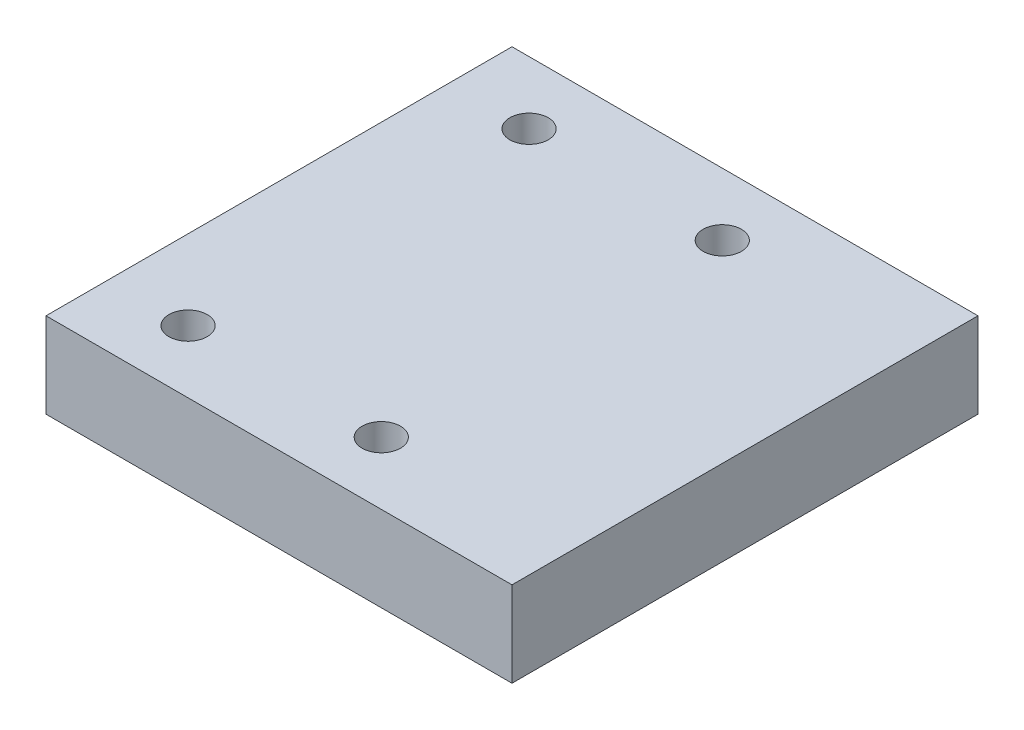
ISO-10303-21;
HEADER;
FILE_DESCRIPTION(('STEP AP214'),'2;1');
FILE_NAME('part.step','',(''),(''),'','','');
FILE_SCHEMA(('AUTOMOTIVE_DESIGN { 1 0 10303 214 1 1 1 1 }'));
ENDSEC;
DATA;
#1=APPLICATION_CONTEXT('core data for automotive mechanical design processes');
#2=APPLICATION_PROTOCOL_DEFINITION('international standard','automotive_design',2000,#1);
#3=PRODUCT_CONTEXT('',#1,'mechanical');
#4=PRODUCT('Part','Part','',(#3));
#5=PRODUCT_RELATED_PRODUCT_CATEGORY('part','',(#4));
#6=PRODUCT_DEFINITION_FORMATION('','',#4);
#7=PRODUCT_DEFINITION_CONTEXT('part definition',#1,'design');
#8=PRODUCT_DEFINITION('design','',#6,#7);
#9=PRODUCT_DEFINITION_SHAPE('','',#8);
#10=(LENGTH_UNIT() NAMED_UNIT(*) SI_UNIT(.MILLI.,.METRE.));
#11=(NAMED_UNIT(*) PLANE_ANGLE_UNIT() SI_UNIT($,.RADIAN.));
#12=(NAMED_UNIT(*) SI_UNIT($,.STERADIAN.) SOLID_ANGLE_UNIT());
#13=UNCERTAINTY_MEASURE_WITH_UNIT(LENGTH_MEASURE(1.E-05),#10,'distance_accuracy_value','');
#14=(GEOMETRIC_REPRESENTATION_CONTEXT(3) GLOBAL_UNCERTAINTY_ASSIGNED_CONTEXT((#13)) GLOBAL_UNIT_ASSIGNED_CONTEXT((#10,
#11,#12)) REPRESENTATION_CONTEXT('',''));
#15=CARTESIAN_POINT('',(0.,0.,0.));
#16=DIRECTION('',(0.,0.,1.));
#17=DIRECTION('',(1.,0.,0.));
#18=AXIS2_PLACEMENT_3D('',#15,#16,#17);
#19=CARTESIAN_POINT('',(-41.,0.,41.));
#20=DIRECTION('',(1.,0.,0.));
#21=DIRECTION('',(0.,0.,-1.));
#22=AXIS2_PLACEMENT_3D('',#19,#20,#21);
#23=PLANE('',#22);
#24=DIRECTION('',(0.,-1.,0.));
#25=VECTOR('',#24,1.);
#26=CARTESIAN_POINT('',(-41.,0.,-41.));
#27=LINE('',#26,#25);
#28=CARTESIAN_POINT('',(-41.,15.,-41.));
#29=VERTEX_POINT('',#28);
#30=CARTESIAN_POINT('',(-41.,0.,-41.));
#31=VERTEX_POINT('',#30);
#32=EDGE_CURVE('E96',#29,#31,#27,.T.);
#33=ORIENTED_EDGE('',*,*,#32,.T.);
#34=DIRECTION('',(0.,0.,-1.));
#35=VECTOR('',#34,1.);
#36=CARTESIAN_POINT('',(-41.,0.,41.));
#37=LINE('',#36,#35);
#38=CARTESIAN_POINT('',(-41.,0.,41.));
#39=VERTEX_POINT('',#38);
#40=EDGE_CURVE('E11',#39,#31,#37,.T.);
#41=ORIENTED_EDGE('',*,*,#40,.F.);
#42=DIRECTION('',(0.,-1.,0.));
#43=VECTOR('',#42,1.);
#44=CARTESIAN_POINT('',(-41.,0.,41.));
#45=LINE('',#44,#43);
#46=CARTESIAN_POINT('',(-41.,15.,41.));
#47=VERTEX_POINT('',#46);
#48=EDGE_CURVE('E84',#47,#39,#45,.T.);
#49=ORIENTED_EDGE('',*,*,#48,.F.);
#50=DIRECTION('',(0.,0.,-1.));
#51=VECTOR('',#50,1.);
#52=CARTESIAN_POINT('',(-41.,15.,41.));
#53=LINE('',#52,#51);
#54=EDGE_CURVE('E92',#47,#29,#53,.T.);
#55=ORIENTED_EDGE('',*,*,#54,.T.);
#56=EDGE_LOOP('',(#33,#41,#49,#55));
#57=FACE_BOUND('',#56,.T.);
#58=ADVANCED_FACE('F33',(#57),#23,.F.);
#59=CARTESIAN_POINT('',(-41.,0.,41.));
#60=DIRECTION('',(0.,1.,0.));
#61=DIRECTION('',(-1.,0.,0.));
#62=AXIS2_PLACEMENT_3D('',#59,#60,#61);
#63=PLANE('',#62);
#64=CARTESIAN_POINT('',(-27.,0.,30.));
#65=DIRECTION('',(0.,1.,0.));
#66=DIRECTION('',(0.,0.,-1.));
#67=AXIS2_PLACEMENT_3D('',#64,#65,#66);
#68=CIRCLE('',#67,3.375);
#69=CARTESIAN_POINT('',(-27.,0.,26.625));
#70=VERTEX_POINT('',#69);
#71=EDGE_CURVE('E125',#70,#70,#68,.T.);
#72=ORIENTED_EDGE('',*,*,#71,.T.);
#73=EDGE_LOOP('',(#72));
#74=FACE_BOUND('',#73,.T.);
#75=CARTESIAN_POINT('',(7.,0.,30.));
#76=DIRECTION('',(0.,1.,0.));
#77=DIRECTION('',(0.,0.,1.));
#78=AXIS2_PLACEMENT_3D('',#75,#76,#77);
#79=CIRCLE('',#78,3.375);
#80=CARTESIAN_POINT('',(7.,0.,33.375));
#81=VERTEX_POINT('',#80);
#82=EDGE_CURVE('E119',#81,#81,#79,.T.);
#83=ORIENTED_EDGE('',*,*,#82,.T.);
#84=EDGE_LOOP('',(#83));
#85=FACE_BOUND('',#84,.T.);
#86=CARTESIAN_POINT('',(7.,0.,-30.));
#87=DIRECTION('',(0.,1.,0.));
#88=DIRECTION('',(0.,0.,-1.));
#89=AXIS2_PLACEMENT_3D('',#86,#87,#88);
#90=CIRCLE('',#89,3.375);
#91=CARTESIAN_POINT('',(7.,0.,-33.375));
#92=VERTEX_POINT('',#91);
#93=EDGE_CURVE('E113',#92,#92,#90,.T.);
#94=ORIENTED_EDGE('',*,*,#93,.T.);
#95=EDGE_LOOP('',(#94));
#96=FACE_BOUND('',#95,.T.);
#97=CARTESIAN_POINT('',(-27.,0.,-30.));
#98=DIRECTION('',(0.,1.,0.));
#99=DIRECTION('',(0.,0.,1.));
#100=AXIS2_PLACEMENT_3D('',#97,#98,#99);
#101=CIRCLE('',#100,3.375);
#102=CARTESIAN_POINT('',(-27.,0.,-26.625));
#103=VERTEX_POINT('',#102);
#104=EDGE_CURVE('E99',#103,#103,#101,.T.);
#105=ORIENTED_EDGE('',*,*,#104,.T.);
#106=EDGE_LOOP('',(#105));
#107=FACE_BOUND('',#106,.T.);
#108=DIRECTION('',(1.,0.,0.));
#109=VECTOR('',#108,1.);
#110=CARTESIAN_POINT('',(-41.,0.,-41.));
#111=LINE('',#110,#109);
#112=CARTESIAN_POINT('',(41.,0.,-41.));
#113=VERTEX_POINT('',#112);
#114=EDGE_CURVE('E88',#31,#113,#111,.T.);
#115=ORIENTED_EDGE('',*,*,#114,.T.);
#116=DIRECTION('',(0.,0.,-1.));
#117=VECTOR('',#116,1.);
#118=CARTESIAN_POINT('',(41.,0.,41.));
#119=LINE('',#118,#117);
#120=CARTESIAN_POINT('',(41.,0.,41.));
#121=VERTEX_POINT('',#120);
#122=EDGE_CURVE('E41',#121,#113,#119,.T.);
#123=ORIENTED_EDGE('',*,*,#122,.F.);
#124=DIRECTION('',(1.,0.,0.));
#125=VECTOR('',#124,1.);
#126=CARTESIAN_POINT('',(-41.,0.,41.));
#127=LINE('',#126,#125);
#128=EDGE_CURVE('E79',#39,#121,#127,.T.);
#129=ORIENTED_EDGE('',*,*,#128,.F.);
#130=ORIENTED_EDGE('',*,*,#40,.T.);
#131=EDGE_LOOP('',(#115,#123,#129,#130));
#132=FACE_BOUND('',#131,.T.);
#133=ADVANCED_FACE('F87',(#74,#85,#96,#107,#132),#63,.F.);
#134=CARTESIAN_POINT('',(41.,0.,41.));
#135=DIRECTION('',(-1.,0.,0.));
#136=DIRECTION('',(0.,0.,1.));
#137=AXIS2_PLACEMENT_3D('',#134,#135,#136);
#138=PLANE('',#137);
#139=DIRECTION('',(0.,1.,0.));
#140=VECTOR('',#139,1.);
#141=CARTESIAN_POINT('',(41.,0.,-41.));
#142=LINE('',#141,#140);
#143=CARTESIAN_POINT('',(41.,15.,-41.));
#144=VERTEX_POINT('',#143);
#145=EDGE_CURVE('E66',#113,#144,#142,.T.);
#146=ORIENTED_EDGE('',*,*,#145,.T.);
#147=DIRECTION('',(0.,0.,-1.));
#148=VECTOR('',#147,1.);
#149=CARTESIAN_POINT('',(41.,15.,41.));
#150=LINE('',#149,#148);
#151=CARTESIAN_POINT('',(41.,15.,41.));
#152=VERTEX_POINT('',#151);
#153=EDGE_CURVE('E89',#152,#144,#150,.T.);
#154=ORIENTED_EDGE('',*,*,#153,.F.);
#155=DIRECTION('',(0.,1.,0.));
#156=VECTOR('',#155,1.);
#157=CARTESIAN_POINT('',(41.,0.,41.));
#158=LINE('',#157,#156);
#159=EDGE_CURVE('E82',#121,#152,#158,.T.);
#160=ORIENTED_EDGE('',*,*,#159,.F.);
#161=ORIENTED_EDGE('',*,*,#122,.T.);
#162=EDGE_LOOP('',(#146,#154,#160,#161));
#163=FACE_BOUND('',#162,.T.);
#164=ADVANCED_FACE('F90',(#163),#138,.F.);
#165=CARTESIAN_POINT('',(-41.,15.,41.));
#166=DIRECTION('',(0.,-1.,0.));
#167=DIRECTION('',(0.,0.,-1.));
#168=AXIS2_PLACEMENT_3D('',#165,#166,#167);
#169=PLANE('',#168);
#170=CARTESIAN_POINT('',(-27.,15.,30.));
#171=DIRECTION('',(0.,1.,0.));
#172=DIRECTION('',(0.,0.,-1.));
#173=AXIS2_PLACEMENT_3D('',#170,#171,#172);
#174=CIRCLE('',#173,3.375);
#175=CARTESIAN_POINT('',(-27.,15.,26.625));
#176=VERTEX_POINT('',#175);
#177=EDGE_CURVE('E128',#176,#176,#174,.T.);
#178=ORIENTED_EDGE('',*,*,#177,.F.);
#179=EDGE_LOOP('',(#178));
#180=FACE_BOUND('',#179,.T.);
#181=CARTESIAN_POINT('',(7.,15.,30.));
#182=DIRECTION('',(0.,1.,0.));
#183=DIRECTION('',(0.,0.,1.));
#184=AXIS2_PLACEMENT_3D('',#181,#182,#183);
#185=CIRCLE('',#184,3.375);
#186=CARTESIAN_POINT('',(7.,15.,33.375));
#187=VERTEX_POINT('',#186);
#188=EDGE_CURVE('E122',#187,#187,#185,.T.);
#189=ORIENTED_EDGE('',*,*,#188,.F.);
#190=EDGE_LOOP('',(#189));
#191=FACE_BOUND('',#190,.T.);
#192=CARTESIAN_POINT('',(7.,15.,-30.));
#193=DIRECTION('',(0.,1.,0.));
#194=DIRECTION('',(0.,0.,-1.));
#195=AXIS2_PLACEMENT_3D('',#192,#193,#194);
#196=CIRCLE('',#195,3.375);
#197=CARTESIAN_POINT('',(7.,15.,-33.375));
#198=VERTEX_POINT('',#197);
#199=EDGE_CURVE('E116',#198,#198,#196,.T.);
#200=ORIENTED_EDGE('',*,*,#199,.F.);
#201=EDGE_LOOP('',(#200));
#202=FACE_BOUND('',#201,.T.);
#203=CARTESIAN_POINT('',(-27.,15.,-30.));
#204=DIRECTION('',(0.,1.,0.));
#205=DIRECTION('',(0.,0.,1.));
#206=AXIS2_PLACEMENT_3D('',#203,#204,#205);
#207=CIRCLE('',#206,3.375);
#208=CARTESIAN_POINT('',(-27.,15.,-26.625));
#209=VERTEX_POINT('',#208);
#210=EDGE_CURVE('E110',#209,#209,#207,.T.);
#211=ORIENTED_EDGE('',*,*,#210,.F.);
#212=EDGE_LOOP('',(#211));
#213=FACE_BOUND('',#212,.T.);
#214=DIRECTION('',(-1.,0.,0.));
#215=VECTOR('',#214,1.);
#216=CARTESIAN_POINT('',(-41.,15.,-41.));
#217=LINE('',#216,#215);
#218=EDGE_CURVE('E72',#144,#29,#217,.T.);
#219=ORIENTED_EDGE('',*,*,#218,.T.);
#220=ORIENTED_EDGE('',*,*,#54,.F.);
#221=DIRECTION('',(-1.,0.,0.));
#222=VECTOR('',#221,1.);
#223=CARTESIAN_POINT('',(-41.,15.,41.));
#224=LINE('',#223,#222);
#225=EDGE_CURVE('E49',#152,#47,#224,.T.);
#226=ORIENTED_EDGE('',*,*,#225,.F.);
#227=ORIENTED_EDGE('',*,*,#153,.T.);
#228=EDGE_LOOP('',(#219,#220,#226,#227));
#229=FACE_BOUND('',#228,.T.);
#230=ADVANCED_FACE('F104',(#180,#191,#202,#213,#229),#169,.F.);
#231=CARTESIAN_POINT('',(-41.,15.,41.));
#232=DIRECTION('',(0.,0.,-1.));
#233=DIRECTION('',(-1.,0.,0.));
#234=AXIS2_PLACEMENT_3D('',#231,#232,#233);
#235=PLANE('',#234);
#236=ORIENTED_EDGE('',*,*,#48,.T.);
#237=ORIENTED_EDGE('',*,*,#128,.T.);
#238=ORIENTED_EDGE('',*,*,#159,.T.);
#239=ORIENTED_EDGE('',*,*,#225,.T.);
#240=EDGE_LOOP('',(#236,#237,#238,#239));
#241=FACE_BOUND('',#240,.T.);
#242=ADVANCED_FACE('F80',(#241),#235,.F.);
#243=CARTESIAN_POINT('',(-41.,15.,-41.));
#244=DIRECTION('',(0.,0.,-1.));
#245=DIRECTION('',(-1.,0.,0.));
#246=AXIS2_PLACEMENT_3D('',#243,#244,#245);
#247=PLANE('',#246);
#248=ORIENTED_EDGE('',*,*,#32,.F.);
#249=ORIENTED_EDGE('',*,*,#218,.F.);
#250=ORIENTED_EDGE('',*,*,#145,.F.);
#251=ORIENTED_EDGE('',*,*,#114,.F.);
#252=EDGE_LOOP('',(#248,#249,#250,#251));
#253=FACE_BOUND('',#252,.T.);
#254=ADVANCED_FACE('F107',(#253),#247,.T.);
#255=CARTESIAN_POINT('',(-27.,0.,-30.));
#256=DIRECTION('',(0.,1.,0.));
#257=DIRECTION('',(0.,0.,1.));
#258=AXIS2_PLACEMENT_3D('',#255,#256,#257);
#259=CYLINDRICAL_SURFACE('',#258,3.375);
#260=ORIENTED_EDGE('',*,*,#104,.F.);
#261=EDGE_LOOP('',(#260));
#262=FACE_BOUND('',#261,.T.);
#263=ORIENTED_EDGE('',*,*,#210,.T.);
#264=EDGE_LOOP('',(#263));
#265=FACE_BOUND('',#264,.T.);
#266=ADVANCED_FACE('F152',(#262,#265),#259,.F.);
#267=CARTESIAN_POINT('',(7.,0.,-30.));
#268=DIRECTION('',(0.,1.,0.));
#269=DIRECTION('',(0.,0.,1.));
#270=AXIS2_PLACEMENT_3D('',#267,#268,#269);
#271=CYLINDRICAL_SURFACE('',#270,3.375);
#272=ORIENTED_EDGE('',*,*,#93,.F.);
#273=EDGE_LOOP('',(#272));
#274=FACE_BOUND('',#273,.T.);
#275=ORIENTED_EDGE('',*,*,#199,.T.);
#276=EDGE_LOOP('',(#275));
#277=FACE_BOUND('',#276,.T.);
#278=ADVANCED_FACE('F154',(#274,#277),#271,.F.);
#279=CARTESIAN_POINT('',(7.,0.,30.));
#280=DIRECTION('',(0.,1.,0.));
#281=DIRECTION('',(0.,0.,1.));
#282=AXIS2_PLACEMENT_3D('',#279,#280,#281);
#283=CYLINDRICAL_SURFACE('',#282,3.375);
#284=ORIENTED_EDGE('',*,*,#82,.F.);
#285=EDGE_LOOP('',(#284));
#286=FACE_BOUND('',#285,.T.);
#287=ORIENTED_EDGE('',*,*,#188,.T.);
#288=EDGE_LOOP('',(#287));
#289=FACE_BOUND('',#288,.T.);
#290=ADVANCED_FACE('F139',(#286,#289),#283,.F.);
#291=CARTESIAN_POINT('',(-27.,0.,30.));
#292=DIRECTION('',(0.,1.,0.));
#293=DIRECTION('',(0.,0.,1.));
#294=AXIS2_PLACEMENT_3D('',#291,#292,#293);
#295=CYLINDRICAL_SURFACE('',#294,3.375);
#296=ORIENTED_EDGE('',*,*,#71,.F.);
#297=EDGE_LOOP('',(#296));
#298=FACE_BOUND('',#297,.T.);
#299=ORIENTED_EDGE('',*,*,#177,.T.);
#300=EDGE_LOOP('',(#299));
#301=FACE_BOUND('',#300,.T.);
#302=ADVANCED_FACE('F136',(#298,#301),#295,.F.);
#303=CLOSED_SHELL('',(#58,#133,#164,#230,#242,#254,#266,#278,#290,#302));
#304=MANIFOLD_SOLID_BREP('B2',#303);
#305=ADVANCED_BREP_SHAPE_REPRESENTATION('',(#18,#304),#14);
#306=SHAPE_DEFINITION_REPRESENTATION(#9,#305);
ENDSEC;
END-ISO-10303-21;
